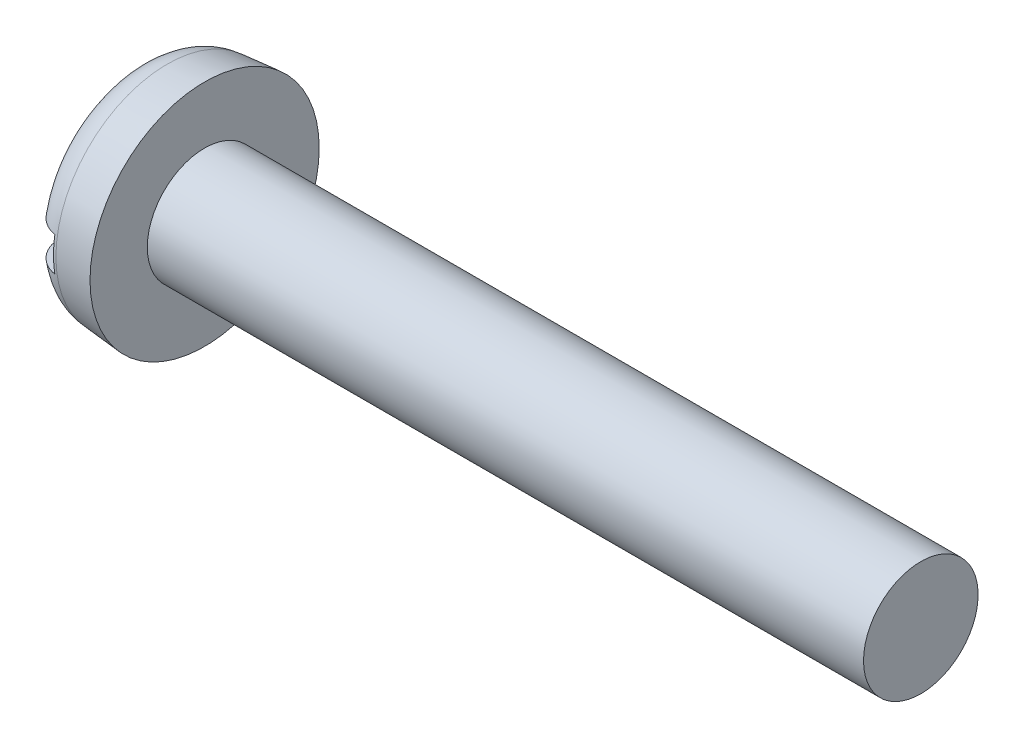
ISO-10303-21;
HEADER;
FILE_DESCRIPTION(('STEP AP214'),'2;1');
FILE_NAME('part.step','',(''),(''),'','','');
FILE_SCHEMA(('AUTOMOTIVE_DESIGN { 1 0 10303 214 1 1 1 1 }'));
ENDSEC;
DATA;
#1=APPLICATION_CONTEXT('core data for automotive mechanical design processes');
#2=APPLICATION_PROTOCOL_DEFINITION('international standard','automotive_design',2000,#1);
#3=PRODUCT_CONTEXT('',#1,'mechanical');
#4=PRODUCT('Part','Part','',(#3));
#5=PRODUCT_RELATED_PRODUCT_CATEGORY('part','',(#4));
#6=PRODUCT_DEFINITION_FORMATION('','',#4);
#7=PRODUCT_DEFINITION_CONTEXT('part definition',#1,'design');
#8=PRODUCT_DEFINITION('design','',#6,#7);
#9=PRODUCT_DEFINITION_SHAPE('','',#8);
#10=(LENGTH_UNIT() NAMED_UNIT(*) SI_UNIT(.MILLI.,.METRE.));
#11=(NAMED_UNIT(*) PLANE_ANGLE_UNIT() SI_UNIT($,.RADIAN.));
#12=(NAMED_UNIT(*) SI_UNIT($,.STERADIAN.) SOLID_ANGLE_UNIT());
#13=UNCERTAINTY_MEASURE_WITH_UNIT(LENGTH_MEASURE(1.E-05),#10,'distance_accuracy_value','');
#14=(GEOMETRIC_REPRESENTATION_CONTEXT(3) GLOBAL_UNCERTAINTY_ASSIGNED_CONTEXT((#13)) GLOBAL_UNIT_ASSIGNED_CONTEXT((#10,
#11,#12)) REPRESENTATION_CONTEXT('',''));
#15=CARTESIAN_POINT('',(0.,0.,0.));
#16=DIRECTION('',(0.,0.,1.));
#17=DIRECTION('',(1.,0.,0.));
#18=AXIS2_PLACEMENT_3D('',#15,#16,#17);
#19=CARTESIAN_POINT('',(0.,0.,0.));
#20=DIRECTION('',(-1.,0.,0.));
#21=DIRECTION('',(0.,0.,1.));
#22=AXIS2_PLACEMENT_3D('',#19,#20,#21);
#23=PLANE('',#22);
#24=DIRECTION('',(0.,0.,-1.));
#25=VECTOR('',#24,1.);
#26=CARTESIAN_POINT('',(0.,0.599999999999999,4.));
#27=LINE('',#26,#25);
#28=CARTESIAN_POINT('',(0.,0.599999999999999,2.62267277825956));
#29=VERTEX_POINT('',#28);
#30=CARTESIAN_POINT('',(0.,0.599999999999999,-2.62267277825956));
#31=VERTEX_POINT('',#30);
#32=EDGE_CURVE('E90',#29,#31,#27,.T.);
#33=ORIENTED_EDGE('',*,*,#32,.F.);
#34=CARTESIAN_POINT('',(0.,0.,0.));
#35=DIRECTION('',(-1.,0.,0.));
#36=DIRECTION('',(0.,0.,1.));
#37=AXIS2_PLACEMENT_3D('',#34,#35,#36);
#38=CIRCLE('',#37,2.69042979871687);
#39=EDGE_CURVE('E96',#29,#31,#38,.T.);
#40=ORIENTED_EDGE('',*,*,#39,.T.);
#41=EDGE_LOOP('',(#33,#40));
#42=FACE_BOUND('',#41,.T.);
#43=ADVANCED_FACE('F37',(#42),#23,.T.);
#44=CARTESIAN_POINT('',(-25.4,0.,0.));
#45=DIRECTION('',(-1.,0.,0.));
#46=DIRECTION('',(0.,0.,1.));
#47=AXIS2_PLACEMENT_3D('',#44,#45,#46);
#48=CYLINDRICAL_SURFACE('',#47,2.);
#49=CARTESIAN_POINT('',(27.4,0.,0.));
#50=DIRECTION('',(-1.,0.,0.));
#51=DIRECTION('',(0.,0.,1.));
#52=AXIS2_PLACEMENT_3D('',#49,#50,#51);
#53=CIRCLE('',#52,2.);
#54=CARTESIAN_POINT('',(27.4,0.,2.));
#55=VERTEX_POINT('',#54);
#56=EDGE_CURVE('E97',#55,#55,#53,.T.);
#57=ORIENTED_EDGE('',*,*,#56,.T.);
#58=EDGE_LOOP('',(#57));
#59=FACE_BOUND('',#58,.T.);
#60=CARTESIAN_POINT('',(2.4,0.,0.));
#61=DIRECTION('',(-1.,0.,0.));
#62=DIRECTION('',(0.,0.,1.));
#63=AXIS2_PLACEMENT_3D('',#60,#61,#62);
#64=CIRCLE('',#63,2.);
#65=CARTESIAN_POINT('',(2.4,0.,2.));
#66=VERTEX_POINT('',#65);
#67=EDGE_CURVE('E154',#66,#66,#64,.T.);
#68=ORIENTED_EDGE('',*,*,#67,.F.);
#69=EDGE_LOOP('',(#68));
#70=FACE_BOUND('',#69,.T.);
#71=ADVANCED_FACE('F142',(#59,#70),#48,.T.);
#72=CARTESIAN_POINT('',(27.4,2.,0.));
#73=DIRECTION('',(1.,0.,0.));
#74=DIRECTION('',(0.,0.,-1.));
#75=AXIS2_PLACEMENT_3D('',#72,#73,#74);
#76=PLANE('',#75);
#77=ORIENTED_EDGE('',*,*,#56,.F.);
#78=EDGE_LOOP('',(#77));
#79=FACE_BOUND('',#78,.T.);
#80=ADVANCED_FACE('F140',(#79),#76,.T.);
#81=DIRECTION('',(0.,0.,1.));
#82=VECTOR('',#81,1.);
#83=CARTESIAN_POINT('',(0.,-0.599999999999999,-4.));
#84=LINE('',#83,#82);
#85=CARTESIAN_POINT('',(0.,-0.6,-2.62267277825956));
#86=VERTEX_POINT('',#85);
#87=CARTESIAN_POINT('',(0.,-0.6,2.62267277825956));
#88=VERTEX_POINT('',#87);
#89=EDGE_CURVE('E81',#86,#88,#84,.T.);
#90=ORIENTED_EDGE('',*,*,#89,.F.);
#91=EDGE_CURVE('E88',#86,#88,#38,.T.);
#92=ORIENTED_EDGE('',*,*,#91,.T.);
#93=EDGE_LOOP('',(#90,#92));
#94=FACE_BOUND('',#93,.T.);
#95=ADVANCED_FACE('F87',(#94),#23,.T.);
#96=CARTESIAN_POINT('',(0.,0.,0.));
#97=DIRECTION('',(1.,0.,0.));
#98=DIRECTION('',(0.,0.,-1.));
#99=AXIS2_PLACEMENT_3D('',#96,#97,#98);
#100=CONICAL_SURFACE('',#99,3.79002720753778,0.0872664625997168);
#101=CARTESIAN_POINT('',(1.09541310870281,0.,0.));
#102=DIRECTION('',(-1.,0.,0.));
#103=DIRECTION('',(0.,0.,1.));
#104=AXIS2_PLACEMENT_3D('',#101,#102,#103);
#105=CIRCLE('',#104,3.88586343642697);
#106=CARTESIAN_POINT('',(1.09541310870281,0.,3.88586343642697));
#107=VERTEX_POINT('',#106);
#108=EDGE_CURVE('E100',#107,#107,#105,.F.);
#109=ORIENTED_EDGE('',*,*,#108,.T.);
#110=EDGE_LOOP('',(#109));
#111=FACE_BOUND('',#110,.T.);
#112=CARTESIAN_POINT('',(2.4,0.,0.));
#113=DIRECTION('',(-1.,0.,0.));
#114=DIRECTION('',(0.,0.,1.));
#115=AXIS2_PLACEMENT_3D('',#112,#113,#114);
#116=CIRCLE('',#115,4.);
#117=CARTESIAN_POINT('',(2.4,0.,4.));
#118=VERTEX_POINT('',#117);
#119=EDGE_CURVE('E102',#118,#118,#116,.T.);
#120=ORIENTED_EDGE('',*,*,#119,.T.);
#121=EDGE_LOOP('',(#120));
#122=FACE_BOUND('',#121,.T.);
#123=ADVANCED_FACE('F133',(#111,#122),#100,.T.);
#124=CARTESIAN_POINT('',(2.4,2.,0.));
#125=DIRECTION('',(-1.,0.,0.));
#126=DIRECTION('',(0.,0.,1.));
#127=AXIS2_PLACEMENT_3D('',#124,#125,#126);
#128=PLANE('',#127);
#129=ORIENTED_EDGE('',*,*,#119,.F.);
#130=EDGE_LOOP('',(#129));
#131=FACE_BOUND('',#130,.T.);
#132=ORIENTED_EDGE('',*,*,#67,.T.);
#133=EDGE_LOOP('',(#132));
#134=FACE_BOUND('',#133,.T.);
#135=ADVANCED_FACE('F129',(#131,#134),#128,.F.);
#136=CARTESIAN_POINT('',(1.2,0.,0.));
#137=DIRECTION('',(-1.,0.,0.));
#138=DIRECTION('',(0.,0.,1.));
#139=AXIS2_PLACEMENT_3D('',#136,#137,#138);
#140=TOROIDAL_SURFACE('',#139,2.69042979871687,1.2);
#141=CARTESIAN_POINT('',(0.555724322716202,0.599999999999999,-3.65387250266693));
#142=CARTESIAN_POINT('',(0.611863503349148,0.599999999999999,-3.69007442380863));
#143=CARTESIAN_POINT('',(0.671083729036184,0.599999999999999,-3.72158508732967));
#144=CARTESIAN_POINT('',(0.79401889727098,0.599999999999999,-3.77425118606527));
#145=CARTESIAN_POINT('',(0.85773880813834,0.599999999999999,-3.79539496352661));
#146=CARTESIAN_POINT('',(0.98781720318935,0.599999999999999,-3.82665867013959));
#147=CARTESIAN_POINT('',(1.05417498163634,0.599999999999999,-3.83678152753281));
#148=CARTESIAN_POINT('',(1.18763076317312,0.599999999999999,-3.8457038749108));
#149=CARTESIAN_POINT('',(1.25472858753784,0.599999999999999,-3.84450604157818));
#150=CARTESIAN_POINT('',(1.3875826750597,0.599999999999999,-3.83084960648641));
#151=CARTESIAN_POINT('',(1.45334209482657,0.599999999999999,-3.81842168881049));
#152=CARTESIAN_POINT('',(1.58184721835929,0.599999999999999,-3.78271705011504));
#153=CARTESIAN_POINT('',(1.64459283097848,0.599999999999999,-3.75944000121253));
#154=CARTESIAN_POINT('',(1.76539749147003,0.599999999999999,-3.70268381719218));
#155=CARTESIAN_POINT('',(1.82344949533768,0.599999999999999,-3.66918969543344));
#156=CARTESIAN_POINT('',(1.93315741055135,0.599999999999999,-3.59299631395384));
#157=CARTESIAN_POINT('',(1.98481318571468,0.599999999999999,-3.55029685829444));
#158=CARTESIAN_POINT('',(2.08067865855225,0.599999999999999,-3.45659366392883));
#159=CARTESIAN_POINT('',(2.12483195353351,0.599999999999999,-3.40553224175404));
#160=CARTESIAN_POINT('',(2.20406927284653,0.599999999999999,-3.2968041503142));
#161=CARTESIAN_POINT('',(2.23915285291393,0.599999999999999,-3.23913715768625));
#162=CARTESIAN_POINT('',(2.29977245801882,0.599999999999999,-3.11803251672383));
#163=CARTESIAN_POINT('',(2.32517621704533,0.599999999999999,-3.0545286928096));
#164=CARTESIAN_POINT('',(2.36518290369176,0.599999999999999,-2.92420898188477));
#165=CARTESIAN_POINT('',(2.37978492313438,0.599999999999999,-2.85739281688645));
#166=CARTESIAN_POINT('',(2.39809162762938,0.599999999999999,-2.720979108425));
#167=CARTESIAN_POINT('',(2.40158167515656,0.599999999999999,-2.65135279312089));
#168=CARTESIAN_POINT('',(2.39710334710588,0.599999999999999,-2.51247199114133));
#169=CARTESIAN_POINT('',(2.3891336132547,0.599999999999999,-2.44321754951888));
#170=CARTESIAN_POINT('',(2.36175648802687,0.599999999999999,-2.30533307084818));
#171=CARTESIAN_POINT('',(2.34208762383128,0.599999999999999,-2.23675493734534));
#172=CARTESIAN_POINT('',(2.29173579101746,0.599999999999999,-2.10376468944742));
#173=CARTESIAN_POINT('',(2.26105116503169,0.599999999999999,-2.03935320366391));
#174=CARTESIAN_POINT('',(2.18883893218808,0.599999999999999,-1.91526992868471));
#175=CARTESIAN_POINT('',(2.1471165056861,0.599999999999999,-1.85571135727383));
#176=CARTESIAN_POINT('',(2.05420440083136,0.599999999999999,-1.74447273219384));
#177=CARTESIAN_POINT('',(2.00301317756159,0.599999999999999,-1.69279396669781));
#178=CARTESIAN_POINT('',(1.89282670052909,0.599999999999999,-1.59935956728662));
#179=CARTESIAN_POINT('',(1.83388602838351,0.599999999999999,-1.55753977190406));
#180=CARTESIAN_POINT('',(1.70948185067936,0.599999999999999,-1.48508690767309));
#181=CARTESIAN_POINT('',(1.64402152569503,0.599999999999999,-1.45444841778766));
#182=CARTESIAN_POINT('',(1.51242704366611,0.599999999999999,-1.40732654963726));
#183=CARTESIAN_POINT('',(1.44654962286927,0.599999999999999,-1.39012852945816));
#184=CARTESIAN_POINT('',(1.31277581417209,0.599999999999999,-1.36804629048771));
#185=CARTESIAN_POINT('',(1.24488075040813,0.599999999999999,-1.36315416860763));
#186=CARTESIAN_POINT('',(1.11440042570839,0.599999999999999,-1.3658663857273));
#187=CARTESIAN_POINT('',(1.05179449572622,0.599999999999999,-1.37257162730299));
#188=CARTESIAN_POINT('',(0.928605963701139,0.599999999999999,-1.39641067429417));
#189=CARTESIAN_POINT('',(0.868023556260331,0.599999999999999,-1.41354547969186));
#190=CARTESIAN_POINT('',(0.750454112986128,0.599999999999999,-1.45742791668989));
#191=CARTESIAN_POINT('',(0.693467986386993,0.599999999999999,-1.48417796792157));
#192=CARTESIAN_POINT('',(0.584374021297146,0.599999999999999,-1.54623887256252));
#193=CARTESIAN_POINT('',(0.532267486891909,0.599999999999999,-1.58155200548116));
#194=CARTESIAN_POINT('',(0.430463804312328,0.599999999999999,-1.66242118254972));
#195=CARTESIAN_POINT('',(0.381204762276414,0.599999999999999,-1.70852877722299));
#196=CARTESIAN_POINT('',(0.29055833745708,0.599999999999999,-1.80792441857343));
#197=CARTESIAN_POINT('',(0.249173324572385,0.599999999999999,-1.8612146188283));
#198=CARTESIAN_POINT('',(0.172904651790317,0.599999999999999,-1.97708145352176));
#199=CARTESIAN_POINT('',(0.138582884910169,0.599999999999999,-2.04002893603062));
#200=CARTESIAN_POINT('',(0.080798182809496,0.599999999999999,-2.1707301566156));
#201=CARTESIAN_POINT('',(0.0573365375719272,0.599999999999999,-2.23848446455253));
#202=CARTESIAN_POINT('',(0.0217170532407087,0.599999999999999,-2.37805490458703));
#203=CARTESIAN_POINT('',(0.0097436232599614,0.599999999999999,-2.44991829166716));
#204=CARTESIAN_POINT('',(-0.00176444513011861,0.599999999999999,-2.59463581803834));
#205=CARTESIAN_POINT('',(-0.00130029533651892,0.599999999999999,-2.66748986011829));
#206=CARTESIAN_POINT('',(0.0120986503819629,0.599999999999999,-2.81089700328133));
#207=CARTESIAN_POINT('',(0.0248384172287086,0.599999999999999,-2.88146827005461));
#208=CARTESIAN_POINT('',(0.0622829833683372,0.599999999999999,-3.01938616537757));
#209=CARTESIAN_POINT('',(0.0869893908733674,0.599999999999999,-3.08673235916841));
#210=CARTESIAN_POINT('',(0.147034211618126,0.599999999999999,-3.21458941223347));
#211=CARTESIAN_POINT('',(0.182112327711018,0.599999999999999,-3.27522270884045));
#212=CARTESIAN_POINT('',(0.262129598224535,0.599999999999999,-3.38951376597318));
#213=CARTESIAN_POINT('',(0.3070551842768,0.599999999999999,-3.4431809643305));
#214=CARTESIAN_POINT('',(0.386487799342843,0.599999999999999,-3.52288800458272));
#215=CARTESIAN_POINT('',(0.41834969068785,0.599999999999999,-3.55161115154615));
#216=CARTESIAN_POINT('',(0.484959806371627,0.599999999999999,-3.60549063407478));
#217=CARTESIAN_POINT('',(0.519707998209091,0.599999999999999,-3.63064700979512));
#218=CARTESIAN_POINT('',(0.555724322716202,0.599999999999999,-3.65387250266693));
#219=B_SPLINE_CURVE_WITH_KNOTS('',3,(#141,#142,#143,#144,#145,#146,#147,#148,#149,#150,#151,
#152,#153,#154,#155,#156,#157,#158,#159,#160,#161,#162,#163,#164,#165,#166,#167,#168,#169,#170,
#171,#172,#173,#174,#175,#176,#177,#178,#179,#180,#181,#182,#183,#184,#185,#186,#187,#188,#189,
#190,#191,#192,#193,#194,#195,#196,#197,#198,#199,#200,#201,#202,#203,#204,#205,#206,#207,#208,
#209,#210,#211,#212,#213,#214,#215,#216,#217,#218),.UNSPECIFIED.,.T.,.F.,(4,2,2,2,2,2,2,2,2,2,2,
2,2,2,2,2,2,2,2,2,2,2,2,2,2,2,2,2,2,2,2,2,2,2,2,2,2,2,4),(0.,0.200243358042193,
0.400711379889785,0.601126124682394,0.801493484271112,1.00131502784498,1.20114261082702,
1.40126472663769,1.60139110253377,1.80296115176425,2.0045410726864,2.20878426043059,
2.4130446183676,2.62122723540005,2.82943452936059,3.04247992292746,3.25555738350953,
3.47268067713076,3.68983942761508,3.90554330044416,4.12114245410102,4.32430364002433,
4.52733431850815,4.71532091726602,4.90332554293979,5.09137751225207,5.27947959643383,
5.48102054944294,5.68262206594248,5.89671811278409,6.11083958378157,6.3283433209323,
6.54582586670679,6.75990916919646,6.97402125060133,7.18315981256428,7.39201200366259,
7.52048040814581,7.64894736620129),.UNSPECIFIED.);
#220=CARTESIAN_POINT('',(1.,0.599999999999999,-3.8268957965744));
#221=VERTEX_POINT('',#220);
#222=EDGE_CURVE('E11',#31,#221,#219,.T.);
#223=ORIENTED_EDGE('',*,*,#222,.F.);
#224=ORIENTED_EDGE('',*,*,#39,.F.);
#225=CARTESIAN_POINT('',(0.502169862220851,0.599999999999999,1.60576049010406));
#226=CARTESIAN_POINT('',(0.554195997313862,0.599999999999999,1.56606149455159));
#227=CARTESIAN_POINT('',(0.609396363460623,0.599999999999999,1.5304748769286));
#228=CARTESIAN_POINT('',(0.724919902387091,0.599999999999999,1.46881203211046));
#229=CARTESIAN_POINT('',(0.78524511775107,0.599999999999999,1.44273961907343));
#230=CARTESIAN_POINT('',(0.909667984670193,0.599999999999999,1.40122623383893));
#231=CARTESIAN_POINT('',(0.973775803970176,0.599999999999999,1.3858154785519));
#232=CARTESIAN_POINT('',(1.10369459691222,0.599999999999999,1.3665995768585));
#233=CARTESIAN_POINT('',(1.16950473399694,0.599999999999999,1.36278883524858));
#234=CARTESIAN_POINT('',(1.29767383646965,0.599999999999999,1.36688511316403));
#235=CARTESIAN_POINT('',(1.36005075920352,0.599999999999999,1.37425454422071));
#236=CARTESIAN_POINT('',(1.48268610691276,0.599999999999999,1.3993323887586));
#237=CARTESIAN_POINT('',(1.54294419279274,0.599999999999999,1.41704244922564));
#238=CARTESIAN_POINT('',(1.66002557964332,0.599999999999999,1.46205841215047));
#239=CARTESIAN_POINT('',(1.7168336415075,0.599999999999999,1.48940370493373));
#240=CARTESIAN_POINT('',(1.82548566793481,0.599999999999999,1.55261257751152));
#241=CARTESIAN_POINT('',(1.87732830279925,0.599999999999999,1.58847843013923));
#242=CARTESIAN_POINT('',(1.97854810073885,0.599999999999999,1.67047725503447));
#243=CARTESIAN_POINT('',(2.02747577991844,0.599999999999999,1.71716517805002));
#244=CARTESIAN_POINT('',(2.11736172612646,0.599999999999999,1.81767012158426));
#245=CARTESIAN_POINT('',(2.15831764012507,0.599999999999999,1.87148923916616));
#246=CARTESIAN_POINT('',(2.23355847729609,0.599999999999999,1.98831219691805));
#247=CARTESIAN_POINT('',(2.26728695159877,0.599999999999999,2.05167539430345));
#248=CARTESIAN_POINT('',(2.32380864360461,0.599999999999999,2.18310973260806));
#249=CARTESIAN_POINT('',(2.34660064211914,0.599999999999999,2.25118139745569));
#250=CARTESIAN_POINT('',(2.38078258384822,0.599999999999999,2.39118439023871));
#251=CARTESIAN_POINT('',(2.39200303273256,0.599999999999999,2.4631572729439));
#252=CARTESIAN_POINT('',(2.40199059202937,0.599999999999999,2.6079662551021));
#253=CARTESIAN_POINT('',(2.40075847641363,0.599999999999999,2.68080230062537));
#254=CARTESIAN_POINT('',(2.38584508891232,0.599999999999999,2.82400920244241));
#255=CARTESIAN_POINT('',(2.37236420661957,0.599999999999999,2.89440086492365));
#256=CARTESIAN_POINT('',(2.33348423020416,0.599999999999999,3.03181492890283));
#257=CARTESIAN_POINT('',(2.30808661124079,0.599999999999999,3.09883774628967));
#258=CARTESIAN_POINT('',(2.24675302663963,0.599999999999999,3.22591541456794));
#259=CARTESIAN_POINT('',(2.21108136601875,0.599999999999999,3.28609785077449));
#260=CARTESIAN_POINT('',(2.12994290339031,0.599999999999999,3.39945330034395));
#261=CARTESIAN_POINT('',(2.08447722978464,0.599999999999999,3.45262712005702));
#262=CARTESIAN_POINT('',(1.98604906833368,0.599999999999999,3.54932660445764));
#263=CARTESIAN_POINT('',(1.93325708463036,0.599999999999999,3.59302587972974));
#264=CARTESIAN_POINT('',(1.82099888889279,0.599999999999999,3.6707908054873));
#265=CARTESIAN_POINT('',(1.76153323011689,0.599999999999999,3.70485725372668));
#266=CARTESIAN_POINT('',(1.63851582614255,0.599999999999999,3.76190993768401));
#267=CARTESIAN_POINT('',(1.575032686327,0.599999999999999,3.78504416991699));
#268=CARTESIAN_POINT('',(1.44506693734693,0.599999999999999,3.82023372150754));
#269=CARTESIAN_POINT('',(1.37858447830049,0.599999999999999,3.83228959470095));
#270=CARTESIAN_POINT('',(1.2450532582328,0.599999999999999,3.84490952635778));
#271=CARTESIAN_POINT('',(1.17801273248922,0.599999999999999,3.84556087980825));
#272=CARTESIAN_POINT('',(1.04477855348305,0.599999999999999,3.83557645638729));
#273=CARTESIAN_POINT('',(0.97858488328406,0.599999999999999,3.82494090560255));
#274=CARTESIAN_POINT('',(0.849043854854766,0.599999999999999,3.79272986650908));
#275=CARTESIAN_POINT('',(0.785691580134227,0.599999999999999,3.77117413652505));
#276=CARTESIAN_POINT('',(0.663485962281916,0.599999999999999,3.71777208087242));
#277=CARTESIAN_POINT('',(0.604632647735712,0.599999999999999,3.68592568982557));
#278=CARTESIAN_POINT('',(0.492838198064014,0.599999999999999,3.61273559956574));
#279=CARTESIAN_POINT('',(0.439920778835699,0.599999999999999,3.57135568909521));
#280=CARTESIAN_POINT('',(0.341703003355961,0.599999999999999,3.48037671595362));
#281=CARTESIAN_POINT('',(0.296402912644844,0.599999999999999,3.4307773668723));
#282=CARTESIAN_POINT('',(0.214216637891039,0.599999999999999,3.32426975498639));
#283=CARTESIAN_POINT('',(0.177416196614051,0.599999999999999,3.26729535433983));
#284=CARTESIAN_POINT('',(0.113734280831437,0.599999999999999,3.14805291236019));
#285=CARTESIAN_POINT('',(0.0868534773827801,0.599999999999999,3.08578451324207));
#286=CARTESIAN_POINT('',(0.0432984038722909,0.599999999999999,2.95667993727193));
#287=CARTESIAN_POINT('',(0.0267920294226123,0.599999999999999,2.88978715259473));
#288=CARTESIAN_POINT('',(0.0049909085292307,0.599999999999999,2.75420476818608));
#289=CARTESIAN_POINT('',(-0.00030316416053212,0.599999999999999,2.68551506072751));
#290=CARTESIAN_POINT('',(0.000336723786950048,0.599999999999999,2.54672879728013));
#291=CARTESIAN_POINT('',(0.00651181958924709,0.599999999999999,2.47663338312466));
#292=CARTESIAN_POINT('',(0.0302683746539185,0.599999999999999,2.33838698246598));
#293=CARTESIAN_POINT('',(0.0478537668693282,0.599999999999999,2.27023667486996));
#294=CARTESIAN_POINT('',(0.0944025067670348,0.599999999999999,2.13614591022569));
#295=CARTESIAN_POINT('',(0.123623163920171,0.599999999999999,2.07029483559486));
#296=CARTESIAN_POINT('',(0.192559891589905,0.599999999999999,1.94438410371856));
#297=CARTESIAN_POINT('',(0.2322674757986,0.599999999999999,1.88431981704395));
#298=CARTESIAN_POINT('',(0.309450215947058,0.599999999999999,1.78645693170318));
#299=CARTESIAN_POINT('',(0.344782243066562,0.599999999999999,1.74694893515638));
#300=CARTESIAN_POINT('',(0.420107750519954,0.599999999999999,1.67265127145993));
#301=CARTESIAN_POINT('',(0.460101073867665,0.599999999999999,1.63786144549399));
#302=CARTESIAN_POINT('',(0.502169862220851,0.599999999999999,1.60576049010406));
#303=B_SPLINE_CURVE_WITH_KNOTS('',3,(#225,#226,#227,#228,#229,#230,#231,#232,#233,#234,#235,
#236,#237,#238,#239,#240,#241,#242,#243,#244,#245,#246,#247,#248,#249,#250,#251,#252,#253,#254,
#255,#256,#257,#258,#259,#260,#261,#262,#263,#264,#265,#266,#267,#268,#269,#270,#271,#272,#273,
#274,#275,#276,#277,#278,#279,#280,#281,#282,#283,#284,#285,#286,#287,#288,#289,#290,#291,#292,
#293,#294,#295,#296,#297,#298,#299,#300,#301,#302),.UNSPECIFIED.,.T.,.F.,(4,2,2,2,2,2,2,2,2,2,2,
2,2,2,2,2,2,2,2,2,2,2,2,2,2,2,2,2,2,2,2,2,2,2,2,2,2,2,4),(0.,0.196155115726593,
0.392388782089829,0.589176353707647,0.785868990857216,0.973398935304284,1.16095875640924,
1.34929442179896,1.53768038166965,1.73969106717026,1.94176129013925,2.15610790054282,
2.37047840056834,2.58794612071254,2.80540032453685,3.01935980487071,3.23329280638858,
3.44215048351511,3.65098411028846,3.85558774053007,4.06017442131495,4.26190596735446,
4.4636274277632,4.66380414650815,4.86397685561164,5.06378867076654,5.26360175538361,
5.46418668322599,5.66477860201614,5.8673133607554,6.0698618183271,6.27560910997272,
6.48136876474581,6.69150348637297,6.90171067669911,7.11685054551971,7.3318168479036,
7.4904349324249,7.64904767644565),.UNSPECIFIED.);
#304=CARTESIAN_POINT('',(1.,0.599999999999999,3.8268957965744));
#305=VERTEX_POINT('',#304);
#306=EDGE_CURVE('E114',#305,#29,#303,.T.);
#307=ORIENTED_EDGE('',*,*,#306,.F.);
#308=CARTESIAN_POINT('',(1.,0.,0.));
#309=DIRECTION('',(-1.,0.,0.));
#310=DIRECTION('',(0.,0.,1.));
#311=AXIS2_PLACEMENT_3D('',#308,#309,#310);
#312=CIRCLE('',#311,3.8736457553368);
#313=CARTESIAN_POINT('',(1.,-0.600000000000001,3.8268957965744));
#314=VERTEX_POINT('',#313);
#315=EDGE_CURVE('E108',#305,#314,#312,.F.);
#316=ORIENTED_EDGE('',*,*,#315,.T.);
#317=CARTESIAN_POINT('',(0.502169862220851,-0.6,1.60576049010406));
#318=CARTESIAN_POINT('',(0.445187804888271,-0.6,1.64924594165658));
#319=CARTESIAN_POINT('',(0.391933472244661,-0.6,1.69773094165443));
#320=CARTESIAN_POINT('',(0.294269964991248,-0.6,1.80302002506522));
#321=CARTESIAN_POINT('',(0.249878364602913,-0.6,1.85984025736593));
#322=CARTESIAN_POINT('',(0.171206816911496,-0.6,1.97997650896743));
#323=CARTESIAN_POINT('',(0.136911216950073,-0.6,2.04328226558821));
#324=CARTESIAN_POINT('',(0.079302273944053,-0.6,2.17467115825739));
#325=CARTESIAN_POINT('',(0.0559837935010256,-0.6,2.24275204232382));
#326=CARTESIAN_POINT('',(0.0208174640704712,-0.6,2.38269571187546));
#327=CARTESIAN_POINT('',(0.00911087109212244,-0.6,2.45459412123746));
#328=CARTESIAN_POINT('',(-0.00186064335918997,-0.6,2.59934603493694));
#329=CARTESIAN_POINT('',(-0.00112505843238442,-0.6,2.67219957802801));
#330=CARTESIAN_POINT('',(0.0128115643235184,-0.6,2.81554909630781));
#331=CARTESIAN_POINT('',(0.0258159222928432,-0.6,2.88606413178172));
#332=CARTESIAN_POINT('',(0.063770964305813,-0.6,3.02380438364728));
#333=CARTESIAN_POINT('',(0.0887200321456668,-0.6,3.09103004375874));
#334=CARTESIAN_POINT('',(0.149209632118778,-0.6,3.21858311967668));
#335=CARTESIAN_POINT('',(0.184484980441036,-0.6,3.279036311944));
#336=CARTESIAN_POINT('',(0.264884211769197,-0.6,3.39299625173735));
#337=CARTESIAN_POINT('',(0.310006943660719,-0.6,3.44650381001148));
#338=CARTESIAN_POINT('',(0.407814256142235,-0.6,3.54391044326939));
#339=CARTESIAN_POINT('',(0.460326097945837,-0.600000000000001,3.58798302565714));
#340=CARTESIAN_POINT('',(0.572092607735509,-0.600000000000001,3.66653552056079));
#341=CARTESIAN_POINT('',(0.631346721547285,-0.600000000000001,3.70101622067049));
#342=CARTESIAN_POINT('',(0.754010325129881,-0.600000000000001,3.75891555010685));
#343=CARTESIAN_POINT('',(0.817349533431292,-0.600000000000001,3.78248314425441));
#344=CARTESIAN_POINT('',(0.947103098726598,-0.600000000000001,3.8185560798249));
#345=CARTESIAN_POINT('',(1.01351729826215,-0.600000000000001,3.831061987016));
#346=CARTESIAN_POINT('',(1.14698149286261,-0.600000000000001,3.84458065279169));
#347=CARTESIAN_POINT('',(1.21402252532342,-0.600000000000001,3.84568204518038));
#348=CARTESIAN_POINT('',(1.34733322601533,-0.600000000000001,3.8365898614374));
#349=CARTESIAN_POINT('',(1.41360291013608,-0.600000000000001,3.82639651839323));
#350=CARTESIAN_POINT('',(1.54336099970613,-0.600000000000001,3.79504996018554));
#351=CARTESIAN_POINT('',(1.60685449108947,-0.600000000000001,3.77391778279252));
#352=CARTESIAN_POINT('',(1.72941080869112,-0.600000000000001,3.72133205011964));
#353=CARTESIAN_POINT('',(1.78847360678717,-0.600000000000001,3.68987842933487));
#354=CARTESIAN_POINT('',(1.90074291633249,-0.600000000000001,3.61743745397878));
#355=CARTESIAN_POINT('',(1.95392663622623,-0.6,3.57641479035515));
#356=CARTESIAN_POINT('',(2.05273165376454,-0.6,3.48610012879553));
#357=CARTESIAN_POINT('',(2.09835269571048,-0.6,3.43680785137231));
#358=CARTESIAN_POINT('',(2.18122399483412,-0.6,3.33086486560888));
#359=CARTESIAN_POINT('',(2.21838996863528,-0.6,3.27414825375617));
#360=CARTESIAN_POINT('',(2.28283903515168,-0.6,3.15535714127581));
#361=CARTESIAN_POINT('',(2.31012151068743,-0.6,3.09328230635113));
#362=CARTESIAN_POINT('',(2.35450773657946,-0.6,2.9645074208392));
#363=CARTESIAN_POINT('',(2.37144545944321,-0.6,2.89775017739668));
#364=CARTESIAN_POINT('',(2.39412527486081,-0.6,2.76236351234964));
#365=CARTESIAN_POINT('',(2.39986625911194,-0.6,2.69373390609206));
#366=CARTESIAN_POINT('',(2.40013189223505,-0.6,2.55499487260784));
#367=CARTESIAN_POINT('',(2.39441545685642,-0.6,2.48488500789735));
#368=CARTESIAN_POINT('',(2.37157048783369,-0.6,2.34655110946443));
#369=CARTESIAN_POINT('',(2.35444050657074,-0.6,2.27832731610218));
#370=CARTESIAN_POINT('',(2.30880229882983,-0.6,2.14403189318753));
#371=CARTESIAN_POINT('',(2.28004015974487,-0.6,2.07804649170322));
#372=CARTESIAN_POINT('',(2.21198205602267,-0.6,1.95173941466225));
#373=CARTESIAN_POINT('',(2.17268418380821,-0.6,1.89141876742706));
#374=CARTESIAN_POINT('',(2.08404278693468,-0.6,1.77746904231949));
#375=CARTESIAN_POINT('',(2.03458266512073,-0.6,1.72393048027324));
#376=CARTESIAN_POINT('',(1.92716812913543,-0.6,1.62615004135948));
#377=CARTESIAN_POINT('',(1.86921365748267,-0.6,1.58190822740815));
#378=CARTESIAN_POINT('',(1.74788146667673,-0.6,1.50544361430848));
#379=CARTESIAN_POINT('',(1.68467867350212,-0.6,1.47294432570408));
#380=CARTESIAN_POINT('',(1.55342236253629,-0.6,1.41999907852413));
#381=CARTESIAN_POINT('',(1.48537275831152,-0.6,1.399543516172));
#382=CARTESIAN_POINT('',(1.35177681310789,-0.6,1.37290195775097));
#383=CARTESIAN_POINT('',(1.28641871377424,-0.6,1.36577077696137));
#384=CARTESIAN_POINT('',(1.15546768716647,-0.6,1.36327728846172));
#385=CARTESIAN_POINT('',(1.0898747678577,-0.6,1.36791458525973));
#386=CARTESIAN_POINT('',(0.963980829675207,-0.6,1.38812170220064));
#387=CARTESIAN_POINT('',(0.903583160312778,-0.6,1.40310206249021));
#388=CARTESIAN_POINT('',(0.786066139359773,-0.6,1.44262683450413));
#389=CARTESIAN_POINT('',(0.728943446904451,-0.6,1.46716129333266));
#390=CARTESIAN_POINT('',(0.64397073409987,-0.6,1.51179271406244));
#391=CARTESIAN_POINT('',(0.614516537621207,-0.6,1.5289173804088));
#392=CARTESIAN_POINT('',(0.557151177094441,-0.6,1.56557223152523));
#393=CARTESIAN_POINT('',(0.529239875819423,-0.6,1.58510220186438));
#394=CARTESIAN_POINT('',(0.502169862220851,-0.6,1.60576049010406));
#395=B_SPLINE_CURVE_WITH_KNOTS('',3,(#317,#318,#319,#320,#321,#322,#323,#324,#325,#326,#327,
#328,#329,#330,#331,#332,#333,#334,#335,#336,#337,#338,#339,#340,#341,#342,#343,#344,#345,#346,
#347,#348,#349,#350,#351,#352,#353,#354,#355,#356,#357,#358,#359,#360,#361,#362,#363,#364,#365,
#366,#367,#368,#369,#370,#371,#372,#373,#374,#375,#376,#377,#378,#379,#380,#381,#382,#383,#384,
#385,#386,#387,#388,#389,#390,#391,#392,#393,#394),.UNSPECIFIED.,.T.,.F.,(4,2,2,2,2,2,2,2,2,2,2,
2,2,2,2,2,2,2,2,2,2,2,2,2,2,2,2,2,2,2,2,2,2,2,2,2,2,2,4),(0.,0.214909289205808,
0.430240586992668,0.645236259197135,0.860131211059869,1.07760937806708,1.29509639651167,
1.50915509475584,1.72318483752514,1.93213930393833,2.14106935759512,2.34574393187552,
2.55040169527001,2.75217693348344,2.95394185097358,3.15413750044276,3.35432901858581,
3.5541369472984,3.75394614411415,3.95450462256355,4.15506988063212,4.35755447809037,
4.56005171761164,4.76571892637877,4.97140649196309,5.1814675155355,5.39155518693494,
5.60650016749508,5.82148409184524,6.0390882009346,6.25669378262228,6.46877775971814,
6.68069238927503,6.87690174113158,7.07310449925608,7.25895986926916,7.44462214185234,
7.5467264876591,7.64882173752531),.UNSPECIFIED.);
#396=EDGE_CURVE('E95',#88,#314,#395,.T.);
#397=ORIENTED_EDGE('',*,*,#396,.F.);
#398=ORIENTED_EDGE('',*,*,#91,.F.);
#399=CARTESIAN_POINT('',(0.555724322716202,-0.599999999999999,-3.65387250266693));
#400=CARTESIAN_POINT('',(0.498734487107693,-0.599999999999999,-3.61711459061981));
#401=CARTESIAN_POINT('',(0.444834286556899,-0.6,-3.57546537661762));
#402=CARTESIAN_POINT('',(0.344782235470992,-0.6,-3.48363725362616));
#403=CARTESIAN_POINT('',(0.298641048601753,-0.6,-3.43344679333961));
#404=CARTESIAN_POINT('',(0.215461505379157,-0.6,-3.32610544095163));
#405=CARTESIAN_POINT('',(0.178413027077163,-0.6,-3.2689623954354));
#406=CARTESIAN_POINT('',(0.114320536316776,-0.6,-3.14934530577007));
#407=CARTESIAN_POINT('',(0.087273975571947,-0.6,-3.08687262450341));
#408=CARTESIAN_POINT('',(0.0435456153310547,-0.6,-2.95757076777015));
#409=CARTESIAN_POINT('',(0.0269912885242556,-0.6,-2.89069851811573));
#410=CARTESIAN_POINT('',(0.00508983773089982,-0.6,-2.75514352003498));
#411=CARTESIAN_POINT('',(-0.000255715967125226,-0.6,-2.68646051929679));
#412=CARTESIAN_POINT('',(0.000280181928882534,-0.6,-2.54767232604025));
#413=CARTESIAN_POINT('',(0.00640389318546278,-0.6,-2.47756809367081));
#414=CARTESIAN_POINT('',(0.030057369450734,-0.6,-2.33931217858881));
#415=CARTESIAN_POINT('',(0.0475885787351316,-0.6,-2.27116074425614));
#416=CARTESIAN_POINT('',(0.0940220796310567,-0.6,-2.13708014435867));
#417=CARTESIAN_POINT('',(0.123177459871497,-0.6,-2.07123856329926));
#418=CARTESIAN_POINT('',(0.191996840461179,-0.6,-1.94528477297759));
#419=CARTESIAN_POINT('',(0.23166272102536,-0.6,-1.88517359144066));
#420=CARTESIAN_POINT('',(0.320994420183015,-0.6,-1.77173274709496));
#421=CARTESIAN_POINT('',(0.370772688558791,-0.6,-1.71849145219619));
#422=CARTESIAN_POINT('',(0.478774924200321,-0.6,-1.62136628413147));
#423=CARTESIAN_POINT('',(0.53699882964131,-0.6,-1.57748234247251));
#424=CARTESIAN_POINT('',(0.658746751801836,-0.6,-1.50181934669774));
#425=CARTESIAN_POINT('',(0.722091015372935,-0.6,-1.46975218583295));
#426=CARTESIAN_POINT('',(0.85355413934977,-0.6,-1.41769610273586));
#427=CARTESIAN_POINT('',(0.9216693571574,-0.6,-1.39769807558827));
#428=CARTESIAN_POINT('',(1.05528073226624,-0.6,-1.37194849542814));
#429=CARTESIAN_POINT('',(1.12059402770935,-0.6,-1.36524668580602));
#430=CARTESIAN_POINT('',(1.2513608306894,-0.6,-1.36358106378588));
#431=CARTESIAN_POINT('',(1.31681429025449,-0.6,-1.36861372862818));
#432=CARTESIAN_POINT('',(1.44243637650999,-0.6,-1.3895462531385));
#433=CARTESIAN_POINT('',(1.50270294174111,-0.6,-1.40486826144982));
#434=CARTESIAN_POINT('',(1.61996472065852,-0.6,-1.44504162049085));
#435=CARTESIAN_POINT('',(1.67695924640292,-0.6,-1.46989496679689));
#436=CARTESIAN_POINT('',(1.78847236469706,-0.6,-1.52925603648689));
#437=CARTESIAN_POINT('',(1.8428136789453,-0.6,-1.56409575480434));
#438=CARTESIAN_POINT('',(1.94542643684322,-0.6,-1.64178505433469));
#439=CARTESIAN_POINT('',(1.99369605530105,-0.6,-1.68463703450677));
#440=CARTESIAN_POINT('',(2.08661844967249,-0.6,-1.78069023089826));
#441=CARTESIAN_POINT('',(2.13071333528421,-0.6,-1.83443193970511));
#442=CARTESIAN_POINT('',(2.20971293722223,-0.6,-1.94829602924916));
#443=CARTESIAN_POINT('',(2.24461542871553,-0.6,-2.00841994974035));
#444=CARTESIAN_POINT('',(2.30564498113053,-0.6,-2.13620099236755));
#445=CARTESIAN_POINT('',(2.33132647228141,-0.6,-2.20407160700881));
#446=CARTESIAN_POINT('',(2.37093013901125,-0.6,-2.34316607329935));
#447=CARTESIAN_POINT('',(2.38485194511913,-0.6,-2.41439003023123));
#448=CARTESIAN_POINT('',(2.40040871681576,-0.6,-2.55814530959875));
#449=CARTESIAN_POINT('',(2.4020489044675,-0.6,-2.63067606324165));
#450=CARTESIAN_POINT('',(2.39285255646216,-0.6,-2.77494594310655));
#451=CARTESIAN_POINT('',(2.38201725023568,-0.6,-2.84668514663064));
#452=CARTESIAN_POINT('',(2.34840555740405,-0.6,-2.98570551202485));
#453=CARTESIAN_POINT('',(2.32588655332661,-0.6,-3.05304886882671));
#454=CARTESIAN_POINT('',(2.26959715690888,-0.6,-3.18285922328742));
#455=CARTESIAN_POINT('',(2.23582815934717,-0.6,-3.24532682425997));
#456=CARTESIAN_POINT('',(2.15885364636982,-0.6,-3.3620818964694));
#457=CARTESIAN_POINT('',(2.11588409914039,-0.6,-3.41652497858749));
#458=CARTESIAN_POINT('',(2.02126247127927,-0.6,-3.51725700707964));
#459=CARTESIAN_POINT('',(1.96961127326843,-0.599999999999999,-3.56354678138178));
#460=CARTESIAN_POINT('',(1.86010105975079,-0.599999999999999,-3.64579800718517));
#461=CARTESIAN_POINT('',(1.80236971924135,-0.599999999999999,-3.68192950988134));
#462=CARTESIAN_POINT('',(1.681608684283,-0.599999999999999,-3.74385467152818));
#463=CARTESIAN_POINT('',(1.61857958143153,-0.599999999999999,-3.76964948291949));
#464=CARTESIAN_POINT('',(1.48979929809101,-0.599999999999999,-3.80988187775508));
#465=CARTESIAN_POINT('',(1.42408810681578,-0.599999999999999,-3.82444755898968));
#466=CARTESIAN_POINT('',(1.29113110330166,-0.599999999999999,-3.84227724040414));
#467=CARTESIAN_POINT('',(1.22388494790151,-0.599999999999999,-3.84553868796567));
#468=CARTESIAN_POINT('',(1.09014166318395,-0.599999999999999,-3.84067025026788));
#469=CARTESIAN_POINT('',(1.02364248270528,-0.599999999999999,-3.83259555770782));
#470=CARTESIAN_POINT('',(0.893005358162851,-0.599999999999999,-3.80539646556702));
#471=CARTESIAN_POINT('',(0.828864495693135,-0.599999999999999,-3.78628624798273));
#472=CARTESIAN_POINT('',(0.729946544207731,-0.599999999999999,-3.74751823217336));
#473=CARTESIAN_POINT('',(0.693813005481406,-0.599999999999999,-3.73122751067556));
#474=CARTESIAN_POINT('',(0.62334316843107,-0.599999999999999,-3.69513810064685));
#475=CARTESIAN_POINT('',(0.589006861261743,-0.599999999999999,-3.67533942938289));
#476=CARTESIAN_POINT('',(0.555724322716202,-0.599999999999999,-3.65387250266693));
#477=B_SPLINE_CURVE_WITH_KNOTS('',3,(#399,#400,#401,#402,#403,#404,#405,#406,#407,#408,#409,
#410,#411,#412,#413,#414,#415,#416,#417,#418,#419,#420,#421,#422,#423,#424,#425,#426,#427,#428,
#429,#430,#431,#432,#433,#434,#435,#436,#437,#438,#439,#440,#441,#442,#443,#444,#445,#446,#447,
#448,#449,#450,#451,#452,#453,#454,#455,#456,#457,#458,#459,#460,#461,#462,#463,#464,#465,#466,
#467,#468,#469,#470,#471,#472,#473,#474,#475,#476),.UNSPECIFIED.,.T.,.F.,(4,2,2,2,2,2,2,2,2,2,2,
2,2,2,2,2,2,2,2,2,2,2,2,2,2,2,2,2,2,2,2,2,2,2,2,2,2,2,4),(0.,0.203300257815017,
0.406877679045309,0.610227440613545,0.813525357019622,1.01924809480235,1.2249996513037,
1.43514627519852,1.64531951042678,1.86034319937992,2.07540537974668,2.29300466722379,
2.51060236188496,2.72247496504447,2.93418753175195,3.13012961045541,3.32601287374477,
3.51172484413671,3.69747571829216,3.89030945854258,4.08320102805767,4.29082627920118,
4.49850173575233,4.71517227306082,4.93184961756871,5.14843482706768,5.36499869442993,
5.57698255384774,5.78894014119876,5.99600218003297,6.20304318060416,6.40637800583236,
6.60969015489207,6.81064719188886,7.01164960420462,7.21167677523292,7.4114474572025,
7.53017708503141,7.64890612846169),.UNSPECIFIED.);
#478=CARTESIAN_POINT('',(1.,-0.599999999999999,-3.8268957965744));
#479=VERTEX_POINT('',#478);
#480=EDGE_CURVE('E49',#479,#86,#477,.T.);
#481=ORIENTED_EDGE('',*,*,#480,.F.);
#482=EDGE_CURVE('E61',#479,#221,#312,.F.);
#483=ORIENTED_EDGE('',*,*,#482,.T.);
#484=EDGE_LOOP('',(#223,#224,#307,#316,#397,#398,#481,#483));
#485=FACE_BOUND('',#484,.T.);
#486=ORIENTED_EDGE('',*,*,#108,.F.);
#487=EDGE_LOOP('',(#486));
#488=FACE_BOUND('',#487,.T.);
#489=ADVANCED_FACE('F39',(#485,#488),#140,.T.);
#490=CARTESIAN_POINT('',(1.,0.599999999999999,4.));
#491=DIRECTION('',(0.,1.,0.));
#492=DIRECTION('',(0.,0.,1.));
#493=AXIS2_PLACEMENT_3D('',#490,#491,#492);
#494=PLANE('',#493);
#495=ORIENTED_EDGE('',*,*,#222,.T.);
#496=DIRECTION('',(0.,0.,-1.));
#497=VECTOR('',#496,1.);
#498=CARTESIAN_POINT('',(1.,0.599999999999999,4.));
#499=LINE('',#498,#497);
#500=EDGE_CURVE('E89',#305,#221,#499,.T.);
#501=ORIENTED_EDGE('',*,*,#500,.F.);
#502=ORIENTED_EDGE('',*,*,#306,.T.);
#503=ORIENTED_EDGE('',*,*,#32,.T.);
#504=EDGE_LOOP('',(#495,#501,#502,#503));
#505=FACE_BOUND('',#504,.T.);
#506=ADVANCED_FACE('F121',(#505),#494,.F.);
#507=CARTESIAN_POINT('',(1.,-0.599999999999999,-4.));
#508=DIRECTION('',(0.,-1.,0.));
#509=DIRECTION('',(0.,0.,-1.));
#510=AXIS2_PLACEMENT_3D('',#507,#508,#509);
#511=PLANE('',#510);
#512=ORIENTED_EDGE('',*,*,#480,.T.);
#513=ORIENTED_EDGE('',*,*,#89,.T.);
#514=ORIENTED_EDGE('',*,*,#396,.T.);
#515=DIRECTION('',(0.,0.,1.));
#516=VECTOR('',#515,1.);
#517=CARTESIAN_POINT('',(1.,-0.599999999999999,-4.));
#518=LINE('',#517,#516);
#519=EDGE_CURVE('E56',#479,#314,#518,.T.);
#520=ORIENTED_EDGE('',*,*,#519,.F.);
#521=EDGE_LOOP('',(#512,#513,#514,#520));
#522=FACE_BOUND('',#521,.T.);
#523=ADVANCED_FACE('F80',(#522),#511,.F.);
#524=CARTESIAN_POINT('',(1.,0.599999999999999,-4.));
#525=DIRECTION('',(-1.,0.,0.));
#526=DIRECTION('',(0.,0.,1.));
#527=AXIS2_PLACEMENT_3D('',#524,#525,#526);
#528=PLANE('',#527);
#529=ORIENTED_EDGE('',*,*,#519,.T.);
#530=ORIENTED_EDGE('',*,*,#315,.F.);
#531=ORIENTED_EDGE('',*,*,#500,.T.);
#532=ORIENTED_EDGE('',*,*,#482,.F.);
#533=EDGE_LOOP('',(#529,#530,#531,#532));
#534=FACE_BOUND('',#533,.T.);
#535=ADVANCED_FACE('F120',(#534),#528,.T.);
#536=CLOSED_SHELL('',(#43,#71,#80,#95,#123,#135,#489,#506,#523,#535));
#537=MANIFOLD_SOLID_BREP('B2',#536);
#538=ADVANCED_BREP_SHAPE_REPRESENTATION('',(#18,#537),#14);
#539=SHAPE_DEFINITION_REPRESENTATION(#9,#538);
ENDSEC;
END-ISO-10303-21;
